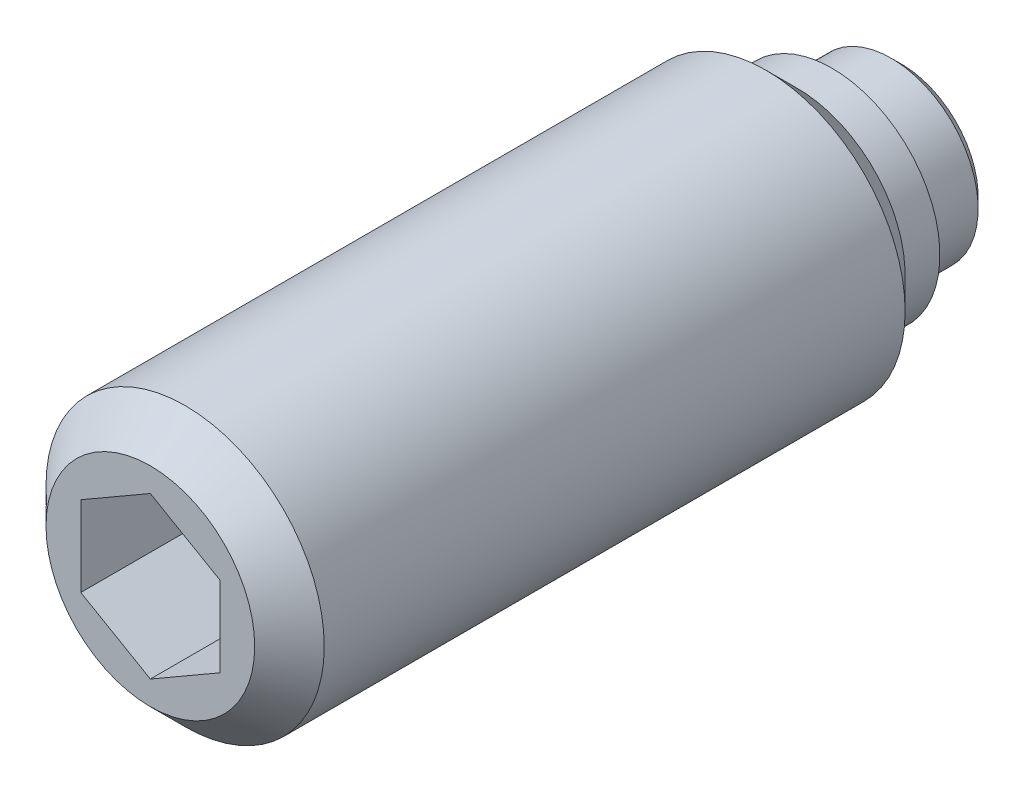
ISO-10303-21;
HEADER;
FILE_DESCRIPTION(('STEP AP214'),'2;1');
FILE_NAME('part.step','',(''),(''),'','','');
FILE_SCHEMA(('AUTOMOTIVE_DESIGN { 1 0 10303 214 1 1 1 1 }'));
ENDSEC;
DATA;
#1=APPLICATION_CONTEXT('core data for automotive mechanical design processes');
#2=APPLICATION_PROTOCOL_DEFINITION('international standard','automotive_design',2000,#1);
#3=PRODUCT_CONTEXT('',#1,'mechanical');
#4=PRODUCT('Part','Part','',(#3));
#5=PRODUCT_RELATED_PRODUCT_CATEGORY('part','',(#4));
#6=PRODUCT_DEFINITION_FORMATION('','',#4);
#7=PRODUCT_DEFINITION_CONTEXT('part definition',#1,'design');
#8=PRODUCT_DEFINITION('design','',#6,#7);
#9=PRODUCT_DEFINITION_SHAPE('','',#8);
#10=(LENGTH_UNIT() NAMED_UNIT(*) SI_UNIT(.MILLI.,.METRE.));
#11=(NAMED_UNIT(*) PLANE_ANGLE_UNIT() SI_UNIT($,.RADIAN.));
#12=(NAMED_UNIT(*) SI_UNIT($,.STERADIAN.) SOLID_ANGLE_UNIT());
#13=UNCERTAINTY_MEASURE_WITH_UNIT(LENGTH_MEASURE(1.E-05),#10,'distance_accuracy_value','');
#14=(GEOMETRIC_REPRESENTATION_CONTEXT(3) GLOBAL_UNCERTAINTY_ASSIGNED_CONTEXT((#13)) GLOBAL_UNIT_ASSIGNED_CONTEXT((#10,
#11,#12)) REPRESENTATION_CONTEXT('',''));
#15=CARTESIAN_POINT('',(0.,0.,0.));
#16=DIRECTION('',(0.,0.,1.));
#17=DIRECTION('',(1.,0.,0.));
#18=AXIS2_PLACEMENT_3D('',#15,#16,#17);
#19=CARTESIAN_POINT('',(0.,0.,0.));
#20=DIRECTION('',(0.,0.,-1.));
#21=DIRECTION('',(-1.,0.,0.));
#22=AXIS2_PLACEMENT_3D('',#19,#20,#21);
#23=CYLINDRICAL_SURFACE('',#22,2.5);
#24=CARTESIAN_POINT('',(0.,0.,0.3));
#25=DIRECTION('',(0.,0.,-1.));
#26=DIRECTION('',(-1.,0.,0.));
#27=AXIS2_PLACEMENT_3D('',#24,#25,#26);
#28=CIRCLE('',#27,2.5);
#29=CARTESIAN_POINT('',(-2.5,0.,0.3));
#30=VERTEX_POINT('',#29);
#31=EDGE_CURVE('E133',#30,#30,#28,.T.);
#32=ORIENTED_EDGE('',*,*,#31,.F.);
#33=EDGE_LOOP('',(#32));
#34=FACE_BOUND('',#33,.T.);
#35=CARTESIAN_POINT('',(0.,0.,2.));
#36=DIRECTION('',(0.,0.,-1.));
#37=DIRECTION('',(-1.,0.,0.));
#38=AXIS2_PLACEMENT_3D('',#35,#36,#37);
#39=CIRCLE('',#38,2.5);
#40=CARTESIAN_POINT('',(-2.5,0.,2.));
#41=VERTEX_POINT('',#40);
#42=EDGE_CURVE('E127',#41,#41,#39,.T.);
#43=ORIENTED_EDGE('',*,*,#42,.T.);
#44=EDGE_LOOP('',(#43));
#45=FACE_BOUND('',#44,.T.);
#46=ADVANCED_FACE('F14',(#34,#45),#23,.T.);
#47=CARTESIAN_POINT('',(0.,0.,0.3));
#48=DIRECTION('',(0.,0.,1.));
#49=DIRECTION('',(1.,0.,0.));
#50=AXIS2_PLACEMENT_3D('',#47,#48,#49);
#51=CONICAL_SURFACE('',#50,2.5,0.785398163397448);
#52=CARTESIAN_POINT('',(0.,0.,0.));
#53=DIRECTION('',(0.,0.,-1.));
#54=DIRECTION('',(-1.,0.,0.));
#55=AXIS2_PLACEMENT_3D('',#52,#53,#54);
#56=CIRCLE('',#55,2.2);
#57=CARTESIAN_POINT('',(-2.2,0.,0.));
#58=VERTEX_POINT('',#57);
#59=EDGE_CURVE('E130',#58,#58,#56,.T.);
#60=ORIENTED_EDGE('',*,*,#59,.F.);
#61=EDGE_LOOP('',(#60));
#62=FACE_BOUND('',#61,.T.);
#63=ORIENTED_EDGE('',*,*,#31,.T.);
#64=EDGE_LOOP('',(#63));
#65=FACE_BOUND('',#64,.T.);
#66=ADVANCED_FACE('F159',(#62,#65),#51,.T.);
#67=CARTESIAN_POINT('',(0.,2.2,0.));
#68=DIRECTION('',(0.,0.,1.));
#69=DIRECTION('',(1.,0.,0.));
#70=AXIS2_PLACEMENT_3D('',#67,#68,#69);
#71=PLANE('',#70);
#72=ORIENTED_EDGE('',*,*,#59,.T.);
#73=EDGE_LOOP('',(#72));
#74=FACE_BOUND('',#73,.T.);
#75=ADVANCED_FACE('F165',(#74),#71,.F.);
#76=CARTESIAN_POINT('',(0.,0.,2.));
#77=DIRECTION('',(0.,0.,-1.));
#78=DIRECTION('',(-1.,0.,0.));
#79=AXIS2_PLACEMENT_3D('',#76,#77,#78);
#80=CYLINDRICAL_SURFACE('',#79,4.);
#81=CARTESIAN_POINT('',(0.,0.,3.9));
#82=DIRECTION('',(0.,0.,-1.));
#83=DIRECTION('',(-1.,0.,0.));
#84=AXIS2_PLACEMENT_3D('',#81,#82,#83);
#85=CIRCLE('',#84,4.);
#86=CARTESIAN_POINT('',(-4.,0.,3.9));
#87=VERTEX_POINT('',#86);
#88=EDGE_CURVE('E9',#87,#87,#85,.T.);
#89=ORIENTED_EDGE('',*,*,#88,.F.);
#90=EDGE_LOOP('',(#89));
#91=FACE_BOUND('',#90,.T.);
#92=CARTESIAN_POINT('',(0.,0.,20.6));
#93=DIRECTION('',(0.,0.,1.));
#94=DIRECTION('',(1.,0.,0.));
#95=AXIS2_PLACEMENT_3D('',#92,#93,#94);
#96=CIRCLE('',#95,4.);
#97=CARTESIAN_POINT('',(4.,0.,20.6));
#98=VERTEX_POINT('',#97);
#99=EDGE_CURVE('E124',#98,#98,#96,.T.);
#100=ORIENTED_EDGE('',*,*,#99,.F.);
#101=EDGE_LOOP('',(#100));
#102=FACE_BOUND('',#101,.T.);
#103=ADVANCED_FACE('F16',(#91,#102),#80,.T.);
#104=CARTESIAN_POINT('',(0.,3.1,2.));
#105=DIRECTION('',(0.,0.,1.));
#106=DIRECTION('',(1.,0.,0.));
#107=AXIS2_PLACEMENT_3D('',#104,#105,#106);
#108=PLANE('',#107);
#109=CARTESIAN_POINT('',(0.,0.,2.));
#110=DIRECTION('',(0.,0.,-1.));
#111=DIRECTION('',(-1.,0.,0.));
#112=AXIS2_PLACEMENT_3D('',#109,#110,#111);
#113=CIRCLE('',#112,3.1);
#114=CARTESIAN_POINT('',(-3.1,0.,2.));
#115=VERTEX_POINT('',#114);
#116=EDGE_CURVE('E136',#115,#115,#113,.T.);
#117=ORIENTED_EDGE('',*,*,#116,.T.);
#118=EDGE_LOOP('',(#117));
#119=FACE_BOUND('',#118,.T.);
#120=ORIENTED_EDGE('',*,*,#42,.F.);
#121=EDGE_LOOP('',(#120));
#122=FACE_BOUND('',#121,.T.);
#123=ADVANCED_FACE('F156',(#119,#122),#108,.F.);
#124=CARTESIAN_POINT('',(0.,0.,2.));
#125=DIRECTION('',(0.,0.,-1.));
#126=DIRECTION('',(-1.,0.,0.));
#127=AXIS2_PLACEMENT_3D('',#124,#125,#126);
#128=CYLINDRICAL_SURFACE('',#127,3.1);
#129=CARTESIAN_POINT('',(0.,0.,3.));
#130=DIRECTION('',(0.,0.,-1.));
#131=DIRECTION('',(-1.,0.,0.));
#132=AXIS2_PLACEMENT_3D('',#129,#130,#131);
#133=CIRCLE('',#132,3.1);
#134=CARTESIAN_POINT('',(-3.1,0.,3.));
#135=VERTEX_POINT('',#134);
#136=EDGE_CURVE('E22',#135,#135,#133,.T.);
#137=ORIENTED_EDGE('',*,*,#136,.T.);
#138=EDGE_LOOP('',(#137));
#139=FACE_BOUND('',#138,.T.);
#140=ORIENTED_EDGE('',*,*,#116,.F.);
#141=EDGE_LOOP('',(#140));
#142=FACE_BOUND('',#141,.T.);
#143=ADVANCED_FACE('F141',(#139,#142),#128,.T.);
#144=CARTESIAN_POINT('',(0.,0.,3.9));
#145=DIRECTION('',(0.,0.,1.));
#146=DIRECTION('',(1.,0.,0.));
#147=AXIS2_PLACEMENT_3D('',#144,#145,#146);
#148=CONICAL_SURFACE('',#147,4.,0.78539816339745);
#149=ORIENTED_EDGE('',*,*,#88,.T.);
#150=EDGE_LOOP('',(#149));
#151=FACE_BOUND('',#150,.T.);
#152=ORIENTED_EDGE('',*,*,#136,.F.);
#153=EDGE_LOOP('',(#152));
#154=FACE_BOUND('',#153,.T.);
#155=ADVANCED_FACE('F144',(#151,#154),#148,.T.);
#156=CARTESIAN_POINT('',(0.,-3.,21.6));
#157=DIRECTION('',(0.,0.,1.));
#158=DIRECTION('',(1.,0.,0.));
#159=AXIS2_PLACEMENT_3D('',#156,#157,#158);
#160=PLANE('',#159);
#161=DIRECTION('',(0.866025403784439,-0.5,0.));
#162=VECTOR('',#161,1.);
#163=CARTESIAN_POINT('',(-2.,-1.15470053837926,21.6));
#164=LINE('',#163,#162);
#165=CARTESIAN_POINT('',(-2.,-1.15470053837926,21.6));
#166=VERTEX_POINT('',#165);
#167=CARTESIAN_POINT('',(0.,-2.30940107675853,21.6));
#168=VERTEX_POINT('',#167);
#169=EDGE_CURVE('E29',#166,#168,#164,.T.);
#170=ORIENTED_EDGE('',*,*,#169,.F.);
#171=DIRECTION('',(0.,-1.,0.));
#172=VECTOR('',#171,1.);
#173=CARTESIAN_POINT('',(-2.,1.15470053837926,21.6));
#174=LINE('',#173,#172);
#175=CARTESIAN_POINT('',(-2.,1.15470053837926,21.6));
#176=VERTEX_POINT('',#175);
#177=EDGE_CURVE('E112',#176,#166,#174,.T.);
#178=ORIENTED_EDGE('',*,*,#177,.F.);
#179=DIRECTION('',(-0.866025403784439,-0.5,0.));
#180=VECTOR('',#179,1.);
#181=CARTESIAN_POINT('',(0.,2.30940107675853,21.6));
#182=LINE('',#181,#180);
#183=CARTESIAN_POINT('',(0.,2.30940107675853,21.6));
#184=VERTEX_POINT('',#183);
#185=EDGE_CURVE('E110',#184,#176,#182,.T.);
#186=ORIENTED_EDGE('',*,*,#185,.F.);
#187=DIRECTION('',(-0.866025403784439,0.5,0.));
#188=VECTOR('',#187,1.);
#189=CARTESIAN_POINT('',(2.,1.15470053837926,21.6));
#190=LINE('',#189,#188);
#191=CARTESIAN_POINT('',(2.,1.15470053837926,21.6));
#192=VERTEX_POINT('',#191);
#193=EDGE_CURVE('E77',#192,#184,#190,.T.);
#194=ORIENTED_EDGE('',*,*,#193,.F.);
#195=DIRECTION('',(0.,1.,0.));
#196=VECTOR('',#195,1.);
#197=CARTESIAN_POINT('',(2.,-1.15470053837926,21.6));
#198=LINE('',#197,#196);
#199=CARTESIAN_POINT('',(2.,-1.15470053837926,21.6));
#200=VERTEX_POINT('',#199);
#201=EDGE_CURVE('E106',#200,#192,#198,.T.);
#202=ORIENTED_EDGE('',*,*,#201,.F.);
#203=DIRECTION('',(0.866025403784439,0.5,0.));
#204=VECTOR('',#203,1.);
#205=CARTESIAN_POINT('',(0.,-2.30940107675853,21.6));
#206=LINE('',#205,#204);
#207=EDGE_CURVE('E103',#168,#200,#206,.T.);
#208=ORIENTED_EDGE('',*,*,#207,.F.);
#209=EDGE_LOOP('',(#170,#178,#186,#194,#202,#208));
#210=FACE_BOUND('',#209,.T.);
#211=CARTESIAN_POINT('',(0.,0.,21.6));
#212=DIRECTION('',(0.,0.,1.));
#213=DIRECTION('',(1.,0.,0.));
#214=AXIS2_PLACEMENT_3D('',#211,#212,#213);
#215=CIRCLE('',#214,3.);
#216=CARTESIAN_POINT('',(3.,0.,21.6));
#217=VERTEX_POINT('',#216);
#218=EDGE_CURVE('E116',#217,#217,#215,.T.);
#219=ORIENTED_EDGE('',*,*,#218,.T.);
#220=EDGE_LOOP('',(#219));
#221=FACE_BOUND('',#220,.T.);
#222=ADVANCED_FACE('F146',(#210,#221),#160,.T.);
#223=CARTESIAN_POINT('',(0.,0.,21.6));
#224=DIRECTION('',(0.,0.,-1.));
#225=DIRECTION('',(-1.,0.,0.));
#226=AXIS2_PLACEMENT_3D('',#223,#224,#225);
#227=CONICAL_SURFACE('',#226,3.,0.785398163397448);
#228=ORIENTED_EDGE('',*,*,#99,.T.);
#229=EDGE_LOOP('',(#228));
#230=FACE_BOUND('',#229,.T.);
#231=ORIENTED_EDGE('',*,*,#218,.F.);
#232=EDGE_LOOP('',(#231));
#233=FACE_BOUND('',#232,.T.);
#234=ADVANCED_FACE('F153',(#230,#233),#227,.T.);
#235=CARTESIAN_POINT('',(-2.,-1.15470053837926,16.6));
#236=DIRECTION('',(-0.5,-0.866025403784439,0.));
#237=DIRECTION('',(0.866025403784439,-0.5,0.));
#238=AXIS2_PLACEMENT_3D('',#235,#236,#237);
#239=PLANE('',#238);
#240=ORIENTED_EDGE('',*,*,#169,.T.);
#241=DIRECTION('',(0.,0.,1.));
#242=VECTOR('',#241,1.);
#243=CARTESIAN_POINT('',(0.,-2.30940107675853,16.6));
#244=LINE('',#243,#242);
#245=CARTESIAN_POINT('',(0.,-2.30940107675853,16.6));
#246=VERTEX_POINT('',#245);
#247=EDGE_CURVE('E59',#246,#168,#244,.T.);
#248=ORIENTED_EDGE('',*,*,#247,.F.);
#249=DIRECTION('',(0.866025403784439,-0.5,0.));
#250=VECTOR('',#249,1.);
#251=CARTESIAN_POINT('',(-2.,-1.15470053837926,16.6));
#252=LINE('',#251,#250);
#253=CARTESIAN_POINT('',(-2.,-1.15470053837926,16.6));
#254=VERTEX_POINT('',#253);
#255=EDGE_CURVE('E114',#254,#246,#252,.T.);
#256=ORIENTED_EDGE('',*,*,#255,.F.);
#257=DIRECTION('',(0.,0.,1.));
#258=VECTOR('',#257,1.);
#259=CARTESIAN_POINT('',(-2.,-1.15470053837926,16.6));
#260=LINE('',#259,#258);
#261=EDGE_CURVE('E37',#254,#166,#260,.T.);
#262=ORIENTED_EDGE('',*,*,#261,.T.);
#263=EDGE_LOOP('',(#240,#248,#256,#262));
#264=FACE_BOUND('',#263,.T.);
#265=ADVANCED_FACE('F191',(#264),#239,.F.);
#266=CARTESIAN_POINT('',(-2.,1.15470053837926,16.6));
#267=DIRECTION('',(-1.,0.,0.));
#268=DIRECTION('',(0.,0.,1.));
#269=AXIS2_PLACEMENT_3D('',#266,#267,#268);
#270=PLANE('',#269);
#271=ORIENTED_EDGE('',*,*,#177,.T.);
#272=ORIENTED_EDGE('',*,*,#261,.F.);
#273=DIRECTION('',(0.,-1.,0.));
#274=VECTOR('',#273,1.);
#275=CARTESIAN_POINT('',(-2.,1.15470053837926,16.6));
#276=LINE('',#275,#274);
#277=CARTESIAN_POINT('',(-2.,1.15470053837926,16.6));
#278=VERTEX_POINT('',#277);
#279=EDGE_CURVE('E89',#278,#254,#276,.T.);
#280=ORIENTED_EDGE('',*,*,#279,.F.);
#281=DIRECTION('',(0.,0.,1.));
#282=VECTOR('',#281,1.);
#283=CARTESIAN_POINT('',(-2.,1.15470053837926,16.6));
#284=LINE('',#283,#282);
#285=EDGE_CURVE('E81',#278,#176,#284,.T.);
#286=ORIENTED_EDGE('',*,*,#285,.T.);
#287=EDGE_LOOP('',(#271,#272,#280,#286));
#288=FACE_BOUND('',#287,.T.);
#289=ADVANCED_FACE('F198',(#288),#270,.F.);
#290=CARTESIAN_POINT('',(0.,2.30940107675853,16.6));
#291=DIRECTION('',(-0.5,0.866025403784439,0.));
#292=DIRECTION('',(-0.866025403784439,-0.5,0.));
#293=AXIS2_PLACEMENT_3D('',#290,#291,#292);
#294=PLANE('',#293);
#295=ORIENTED_EDGE('',*,*,#185,.T.);
#296=ORIENTED_EDGE('',*,*,#285,.F.);
#297=DIRECTION('',(-0.866025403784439,-0.5,0.));
#298=VECTOR('',#297,1.);
#299=CARTESIAN_POINT('',(0.,2.30940107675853,16.6));
#300=LINE('',#299,#298);
#301=CARTESIAN_POINT('',(0.,2.30940107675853,16.6));
#302=VERTEX_POINT('',#301);
#303=EDGE_CURVE('E85',#302,#278,#300,.T.);
#304=ORIENTED_EDGE('',*,*,#303,.F.);
#305=DIRECTION('',(0.,0.,1.));
#306=VECTOR('',#305,1.);
#307=CARTESIAN_POINT('',(0.,2.30940107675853,16.6));
#308=LINE('',#307,#306);
#309=EDGE_CURVE('E70',#302,#184,#308,.T.);
#310=ORIENTED_EDGE('',*,*,#309,.T.);
#311=EDGE_LOOP('',(#295,#296,#304,#310));
#312=FACE_BOUND('',#311,.T.);
#313=ADVANCED_FACE('F86',(#312),#294,.F.);
#314=CARTESIAN_POINT('',(2.,1.15470053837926,16.6));
#315=DIRECTION('',(0.5,0.866025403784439,0.));
#316=DIRECTION('',(-0.866025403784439,0.5,0.));
#317=AXIS2_PLACEMENT_3D('',#314,#315,#316);
#318=PLANE('',#317);
#319=ORIENTED_EDGE('',*,*,#193,.T.);
#320=ORIENTED_EDGE('',*,*,#309,.F.);
#321=DIRECTION('',(-0.866025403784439,0.5,0.));
#322=VECTOR('',#321,1.);
#323=CARTESIAN_POINT('',(2.,1.15470053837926,16.6));
#324=LINE('',#323,#322);
#325=CARTESIAN_POINT('',(2.,1.15470053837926,16.6));
#326=VERTEX_POINT('',#325);
#327=EDGE_CURVE('E74',#326,#302,#324,.T.);
#328=ORIENTED_EDGE('',*,*,#327,.F.);
#329=DIRECTION('',(0.,0.,1.));
#330=VECTOR('',#329,1.);
#331=CARTESIAN_POINT('',(2.,1.15470053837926,16.6));
#332=LINE('',#331,#330);
#333=EDGE_CURVE('E82',#326,#192,#332,.T.);
#334=ORIENTED_EDGE('',*,*,#333,.T.);
#335=EDGE_LOOP('',(#319,#320,#328,#334));
#336=FACE_BOUND('',#335,.T.);
#337=ADVANCED_FACE('F72',(#336),#318,.F.);
#338=CARTESIAN_POINT('',(2.,-1.15470053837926,16.6));
#339=DIRECTION('',(1.,0.,0.));
#340=DIRECTION('',(0.,0.,-1.));
#341=AXIS2_PLACEMENT_3D('',#338,#339,#340);
#342=PLANE('',#341);
#343=ORIENTED_EDGE('',*,*,#201,.T.);
#344=ORIENTED_EDGE('',*,*,#333,.F.);
#345=DIRECTION('',(0.,1.,0.));
#346=VECTOR('',#345,1.);
#347=CARTESIAN_POINT('',(2.,-1.15470053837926,16.6));
#348=LINE('',#347,#346);
#349=CARTESIAN_POINT('',(2.,-1.15470053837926,16.6));
#350=VERTEX_POINT('',#349);
#351=EDGE_CURVE('E95',#350,#326,#348,.T.);
#352=ORIENTED_EDGE('',*,*,#351,.F.);
#353=DIRECTION('',(0.,0.,1.));
#354=VECTOR('',#353,1.);
#355=CARTESIAN_POINT('',(2.,-1.15470053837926,16.6));
#356=LINE('',#355,#354);
#357=EDGE_CURVE('E119',#350,#200,#356,.T.);
#358=ORIENTED_EDGE('',*,*,#357,.T.);
#359=EDGE_LOOP('',(#343,#344,#352,#358));
#360=FACE_BOUND('',#359,.T.);
#361=ADVANCED_FACE('F204',(#360),#342,.F.);
#362=CARTESIAN_POINT('',(0.,-2.30940107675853,16.6));
#363=DIRECTION('',(0.5,-0.866025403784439,0.));
#364=DIRECTION('',(0.866025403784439,0.5,0.));
#365=AXIS2_PLACEMENT_3D('',#362,#363,#364);
#366=PLANE('',#365);
#367=ORIENTED_EDGE('',*,*,#207,.T.);
#368=ORIENTED_EDGE('',*,*,#357,.F.);
#369=DIRECTION('',(0.866025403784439,0.5,0.));
#370=VECTOR('',#369,1.);
#371=CARTESIAN_POINT('',(0.,-2.30940107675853,16.6));
#372=LINE('',#371,#370);
#373=EDGE_CURVE('E97',#246,#350,#372,.T.);
#374=ORIENTED_EDGE('',*,*,#373,.F.);
#375=ORIENTED_EDGE('',*,*,#247,.T.);
#376=EDGE_LOOP('',(#367,#368,#374,#375));
#377=FACE_BOUND('',#376,.T.);
#378=ADVANCED_FACE('F201',(#377),#366,.F.);
#379=CARTESIAN_POINT('',(0.,0.,16.6));
#380=DIRECTION('',(0.,0.,1.));
#381=DIRECTION('',(1.,0.,0.));
#382=AXIS2_PLACEMENT_3D('',#379,#380,#381);
#383=PLANE('',#382);
#384=ORIENTED_EDGE('',*,*,#255,.T.);
#385=ORIENTED_EDGE('',*,*,#373,.T.);
#386=ORIENTED_EDGE('',*,*,#351,.T.);
#387=ORIENTED_EDGE('',*,*,#327,.T.);
#388=ORIENTED_EDGE('',*,*,#303,.T.);
#389=ORIENTED_EDGE('',*,*,#279,.T.);
#390=EDGE_LOOP('',(#384,#385,#386,#387,#388,#389));
#391=FACE_BOUND('',#390,.T.);
#392=ADVANCED_FACE('F92',(#391),#383,.T.);
#393=CLOSED_SHELL('',(#46,#66,#75,#103,#123,#143,#155,#222,#234,#265,#289,#313,#337,#361,#378,#392));
#394=MANIFOLD_SOLID_BREP('B1',#393);
#395=ADVANCED_BREP_SHAPE_REPRESENTATION('',(#18,#394),#14);
#396=SHAPE_DEFINITION_REPRESENTATION(#9,#395);
ENDSEC;
END-ISO-10303-21;
